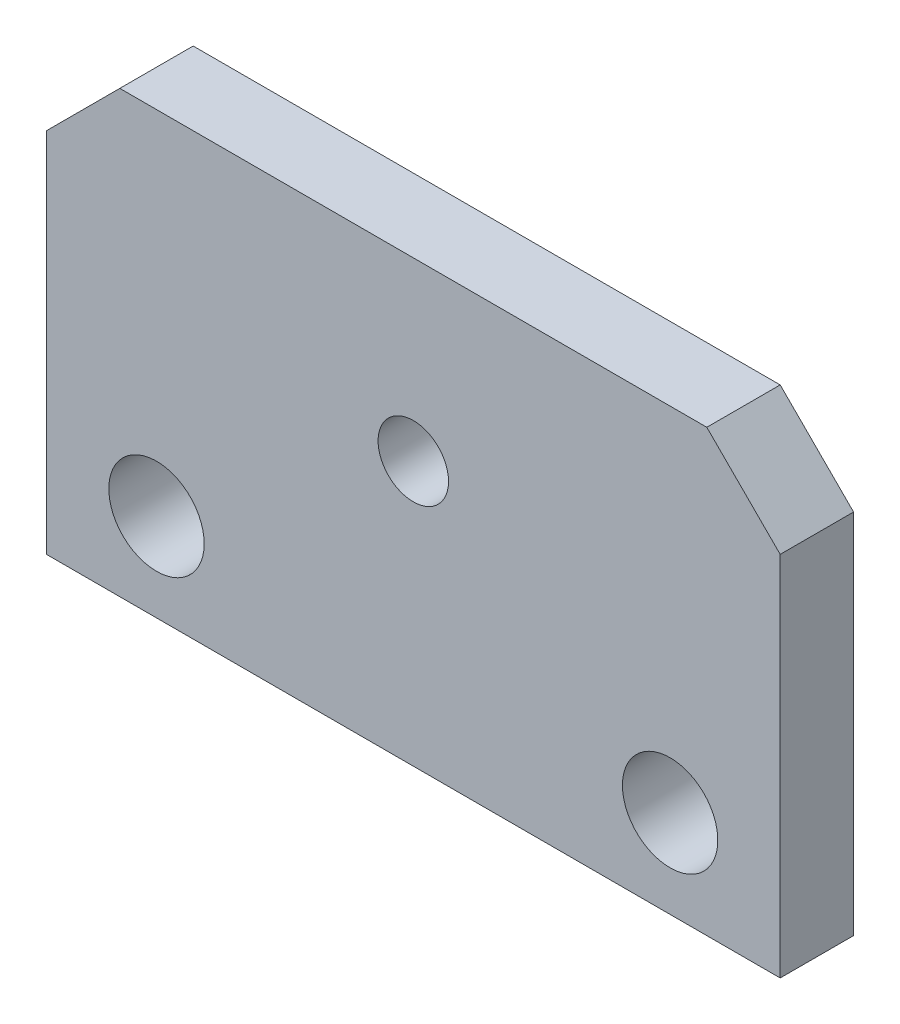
from build123d import *

# Parameters (mm, degrees)
ESQUISSE1_W             = 50
ESQUISSE1_H             = 30
EXTRUSION1_DEPTH        = 5
CHANFREIN1_SIZE         = 5
ESQUISSE2_R             = 3.25
ENL_V_MAT_EXTRU_1_DEPTH = 40.37003937
TROU_TARAUD_M6X1_01_D   = 4.8


with BuildPart() as part:
    # Esquisse1 → Extrusion1 (new body)
    with BuildSketch(Plane.XY):
        with Locations((0, 15)):
            Rectangle(ESQUISSE1_W, ESQUISSE1_H)
    extrude(amount=EXTRUSION1_DEPTH)

    # Chanfrein1
    chanfrein1_edges = [part.edges().sort_by_distance(p)[0] for p in [
        (25, 30, 2.5),
        (-25, 30, 2.5),
    ]]
    chamfer(chanfrein1_edges, length=CHANFREIN1_SIZE)

    # Esquisse2 → Enl_v. mat.-Extru.1 (cut, through all)
    with BuildSketch(Plane.XY.offset(5)):
        with Locations((-17.5, 6)):
            Circle(ESQUISSE2_R)
        with Locations(Location((17.5, 6, 0), (0, 0, 180))):
            Circle(ESQUISSE2_R)
    extrude(amount=-ENL_V_MAT_EXTRU_1_DEPTH, mode=Mode.SUBTRACT)

    # Trou taraud_ M6x1.01 (through all)
    with Locations(Plane.XY.offset(5)):
        with Locations((0, 18)):
            Hole(TROU_TARAUD_M6X1_01_D / 2)


solid = part.part
